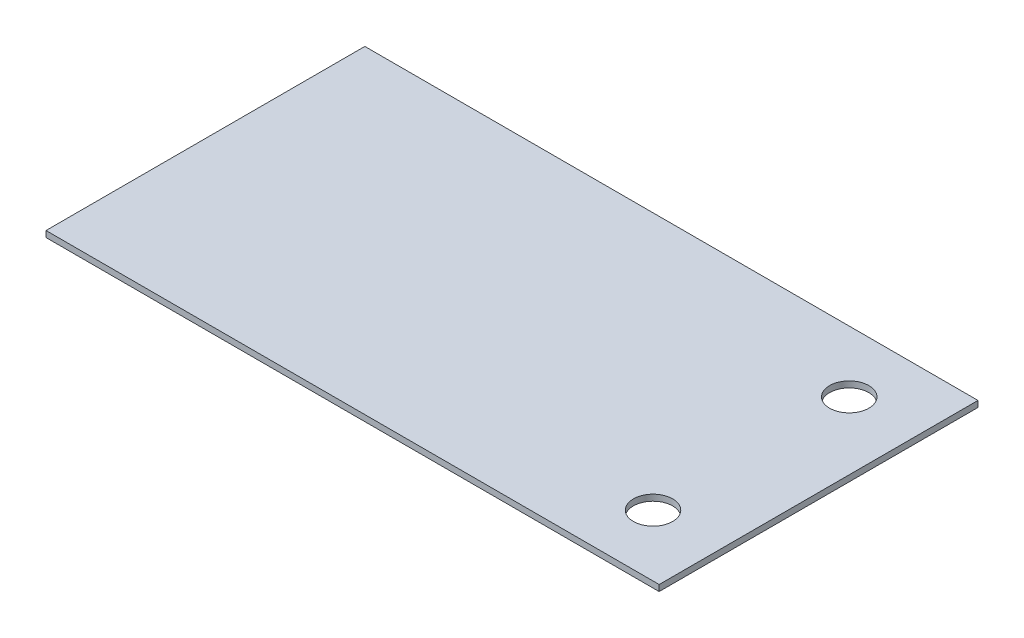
from build123d import *

# Parameters (mm, degrees)
ESQUISSE1_W        = 50
ESQUISSE1_H        = 26
ESQUISSE1_R        = 1.6
BOSS_EXTRU_1_DEPTH = 0.5


with BuildPart() as part:
    # Esquisse1 → Boss.-Extru.1 (new body)
    with BuildSketch(Plane(origin=(0, 0, 0), x_dir=(1, 0, 0), z_dir=(0, 1, 0))):
        with Locations((25, 13)):
            Rectangle(ESQUISSE1_W, ESQUISSE1_H)
        with Locations(Location((44.5, 21, 0), (0, 0, 270))):
            Circle(ESQUISSE1_R, mode=Mode.SUBTRACT)
        with Locations(Location((44.5, 5, 0), (0, 0, 270))):
            Circle(ESQUISSE1_R, mode=Mode.SUBTRACT)
    extrude(amount=BOSS_EXTRU_1_DEPTH)


solid = part.part
